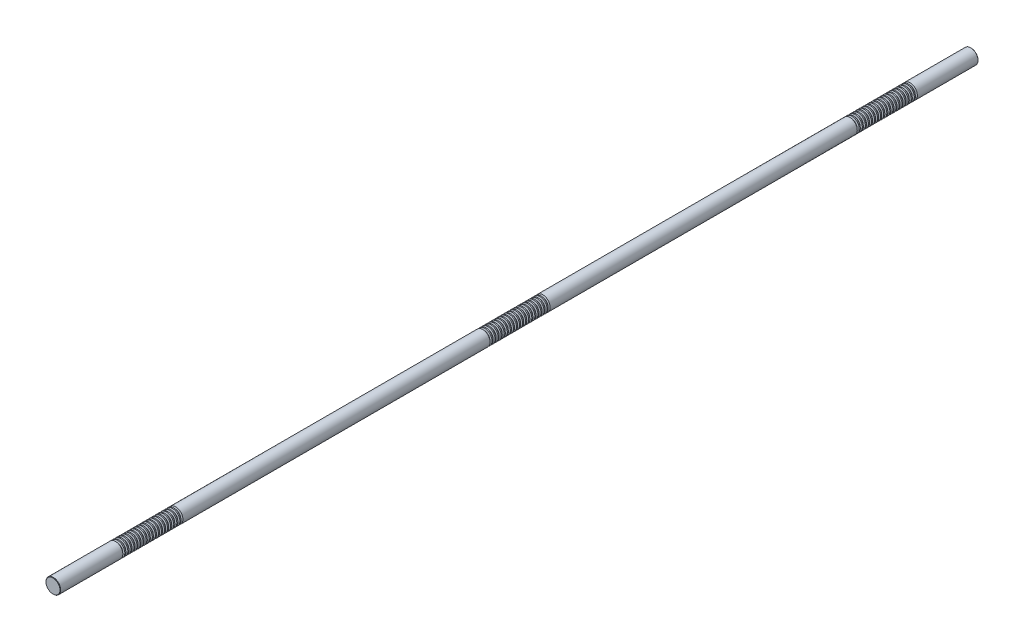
from build123d import *

# Parameters (mm, degrees)
SKETCH1_R           = 12
BOSS_EXTRUDE1_DEPTH = 750
CHAMFER1_SIZE       = 0.6
LPATTERN1_COUNT     = 20
LPATTERN1_PITCH     = 5
LPATTERN2_COUNT     = 3
LPATTERN2_PITCH     = 600


with BuildPart() as part:
    # Sketch1 → Boss-Extrude1 (new, symmetric)
    with BuildSketch(Plane.XY):
        Circle(SKETCH1_R)
    extrude(amount=BOSS_EXTRUDE1_DEPTH, both=True)

    # Chamfer1
    chamfer1_edges = [part.edges().sort_by_distance(p)[0] for p in [
        (-12, 0, -750),
        (-12, 0, 750),
    ]]
    chamfer(chamfer1_edges, length=CHAMFER1_SIZE)

    # Sketch2 → Cut-Revolve1 (revolve, cut)
    with BuildSketch(Plane(origin=(0, 0, 0), x_dir=(0, 0, -1), z_dir=(1, 0, 0)), mode=Mode.PRIVATE) as cut_revolve1_sk:
        Polygon((650.36843014, 12), (647.13156986, 12), (647.86843014, 9.25), (649.63156986, 9.25), align=None)
    cut_revolve1 = revolve(cut_revolve1_sk.sketch.rotate(Axis((0, 0, 750), (0, 0, -1)), 90), axis=Axis((0, 0, 750), (0, 0, -1)), mode=Mode.SUBTRACT)

    # LPattern1: Cut-Revolve1 ×20
    with Locations(*[(0, 0, i * LPATTERN1_PITCH) for i in range(1, LPATTERN1_COUNT)]):
        add(cut_revolve1, mode=Mode.SUBTRACT)

    # LPattern2: Cut-Revolve1 ×3
    with Locations(*[(0, 0, i * LPATTERN2_PITCH) for i in range(1, LPATTERN2_COUNT)]):
        add(cut_revolve1, mode=Mode.SUBTRACT)

    # LPattern2 copy 1 sketch → LPattern2 copy 1 (revolve, cut)
    with BuildSketch(Plane(origin=(0, 0, 605), x_dir=(0, 0, -1), z_dir=(1, 0, 0))):
        Polygon((650.36843014, 12), (647.13156986, 12), (647.86843014, 9.25), (649.63156986, 9.25), align=None)
    revolve(axis=Axis((0, 0, 1355), (0, 0, -1)), mode=Mode.SUBTRACT)

    # LPattern2 copy 2 sketch → LPattern2 copy 2 (revolve, cut)
    with BuildSketch(Plane(origin=(0, 0, 1205), x_dir=(0, 0, -1), z_dir=(1, 0, 0))):
        Polygon((650.36843014, 12), (647.13156986, 12), (647.86843014, 9.25), (649.63156986, 9.25), align=None)
    revolve(axis=Axis((0, 0, 1955), (0, 0, -1)), mode=Mode.SUBTRACT)

    # LPattern2 copy 3 sketch → LPattern2 copy 3 (revolve, cut)
    with BuildSketch(Plane(origin=(0, 0, 610), x_dir=(0, 0, -1), z_dir=(1, 0, 0))):
        Polygon((650.36843014, 12), (647.13156986, 12), (647.86843014, 9.25), (649.63156986, 9.25), align=None)
    revolve(axis=Axis((0, 0, 1360), (0, 0, -1)), mode=Mode.SUBTRACT)

    # LPattern2 copy 4 sketch → LPattern2 copy 4 (revolve, cut)
    with BuildSketch(Plane(origin=(0, 0, 1210), x_dir=(0, 0, -1), z_dir=(1, 0, 0))):
        Polygon((650.36843014, 12), (647.13156986, 12), (647.86843014, 9.25), (649.63156986, 9.25), align=None)
    revolve(axis=Axis((0, 0, 1960), (0, 0, -1)), mode=Mode.SUBTRACT)

    # LPattern2 copy 5 sketch → LPattern2 copy 5 (revolve, cut)
    with BuildSketch(Plane(origin=(0, 0, 615), x_dir=(0, 0, -1), z_dir=(1, 0, 0))):
        Polygon((650.36843014, 12), (647.13156986, 12), (647.86843014, 9.25), (649.63156986, 9.25), align=None)
    revolve(axis=Axis((0, 0, 1365), (0, 0, -1)), mode=Mode.SUBTRACT)

    # LPattern2 copy 6 sketch → LPattern2 copy 6 (revolve, cut)
    with BuildSketch(Plane(origin=(0, 0, 1215), x_dir=(0, 0, -1), z_dir=(1, 0, 0))):
        Polygon((650.36843014, 12), (647.13156986, 12), (647.86843014, 9.25), (649.63156986, 9.25), align=None)
    revolve(axis=Axis((0, 0, 1965), (0, 0, -1)), mode=Mode.SUBTRACT)

    # LPattern2 copy 7 sketch → LPattern2 copy 7 (revolve, cut)
    with BuildSketch(Plane(origin=(0, 0, 620), x_dir=(0, 0, -1), z_dir=(1, 0, 0))):
        Polygon((650.36843014, 12), (647.13156986, 12), (647.86843014, 9.25), (649.63156986, 9.25), align=None)
    revolve(axis=Axis((0, 0, 1370), (0, 0, -1)), mode=Mode.SUBTRACT)

    # LPattern2 copy 8 sketch → LPattern2 copy 8 (revolve, cut)
    with BuildSketch(Plane(origin=(0, 0, 1220), x_dir=(0, 0, -1), z_dir=(1, 0, 0))):
        Polygon((650.36843014, 12), (647.13156986, 12), (647.86843014, 9.25), (649.63156986, 9.25), align=None)
    revolve(axis=Axis((0, 0, 1970), (0, 0, -1)), mode=Mode.SUBTRACT)

    # LPattern2 copy 9 sketch → LPattern2 copy 9 (revolve, cut)
    with BuildSketch(Plane(origin=(0, 0, 625), x_dir=(0, 0, -1), z_dir=(1, 0, 0))):
        Polygon((650.36843014, 12), (647.13156986, 12), (647.86843014, 9.25), (649.63156986, 9.25), align=None)
    revolve(axis=Axis((0, 0, 1375), (0, 0, -1)), mode=Mode.SUBTRACT)

    # LPattern2 copy 10 sketch → LPattern2 copy 10 (revolve, cut)
    with BuildSketch(Plane(origin=(0, 0, 1225), x_dir=(0, 0, -1), z_dir=(1, 0, 0))):
        Polygon((650.36843014, 12), (647.13156986, 12), (647.86843014, 9.25), (649.63156986, 9.25), align=None)
    revolve(axis=Axis((0, 0, 1975), (0, 0, -1)), mode=Mode.SUBTRACT)

    # LPattern2 copy 11 sketch → LPattern2 copy 11 (revolve, cut)
    with BuildSketch(Plane(origin=(0, 0, 630), x_dir=(0, 0, -1), z_dir=(1, 0, 0))):
        Polygon((650.36843014, 12), (647.13156986, 12), (647.86843014, 9.25), (649.63156986, 9.25), align=None)
    revolve(axis=Axis((0, 0, 1380), (0, 0, -1)), mode=Mode.SUBTRACT)

    # LPattern2 copy 12 sketch → LPattern2 copy 12 (revolve, cut)
    with BuildSketch(Plane(origin=(0, 0, 1230), x_dir=(0, 0, -1), z_dir=(1, 0, 0))):
        Polygon((650.36843014, 12), (647.13156986, 12), (647.86843014, 9.25), (649.63156986, 9.25), align=None)
    revolve(axis=Axis((0, 0, 1980), (0, 0, -1)), mode=Mode.SUBTRACT)

    # LPattern2 copy 13 sketch → LPattern2 copy 13 (revolve, cut)
    with BuildSketch(Plane(origin=(0, 0, 635), x_dir=(0, 0, -1), z_dir=(1, 0, 0))):
        Polygon((650.36843014, 12), (647.13156986, 12), (647.86843014, 9.25), (649.63156986, 9.25), align=None)
    revolve(axis=Axis((0, 0, 1385), (0, 0, -1)), mode=Mode.SUBTRACT)

    # LPattern2 copy 14 sketch → LPattern2 copy 14 (revolve, cut)
    with BuildSketch(Plane(origin=(0, 0, 1235), x_dir=(0, 0, -1), z_dir=(1, 0, 0))):
        Polygon((650.36843014, 12), (647.13156986, 12), (647.86843014, 9.25), (649.63156986, 9.25), align=None)
    revolve(axis=Axis((0, 0, 1985), (0, 0, -1)), mode=Mode.SUBTRACT)

    # LPattern2 copy 15 sketch → LPattern2 copy 15 (revolve, cut)
    with BuildSketch(Plane(origin=(0, 0, 640), x_dir=(0, 0, -1), z_dir=(1, 0, 0))):
        Polygon((650.36843014, 12), (647.13156986, 12), (647.86843014, 9.25), (649.63156986, 9.25), align=None)
    revolve(axis=Axis((0, 0, 1390), (0, 0, -1)), mode=Mode.SUBTRACT)

    # LPattern2 copy 16 sketch → LPattern2 copy 16 (revolve, cut)
    with BuildSketch(Plane(origin=(0, 0, 1240), x_dir=(0, 0, -1), z_dir=(1, 0, 0))):
        Polygon((650.36843014, 12), (647.13156986, 12), (647.86843014, 9.25), (649.63156986, 9.25), align=None)
    revolve(axis=Axis((0, 0, 1990), (0, 0, -1)), mode=Mode.SUBTRACT)

    # LPattern2 copy 17 sketch → LPattern2 copy 17 (revolve, cut)
    with BuildSketch(Plane(origin=(0, 0, 645), x_dir=(0, 0, -1), z_dir=(1, 0, 0))):
        Polygon((650.36843014, 12), (647.13156986, 12), (647.86843014, 9.25), (649.63156986, 9.25), align=None)
    revolve(axis=Axis((0, 0, 1395), (0, 0, -1)), mode=Mode.SUBTRACT)

    # LPattern2 copy 18 sketch → LPattern2 copy 18 (revolve, cut)
    with BuildSketch(Plane(origin=(0, 0, 1245), x_dir=(0, 0, -1), z_dir=(1, 0, 0))):
        Polygon((650.36843014, 12), (647.13156986, 12), (647.86843014, 9.25), (649.63156986, 9.25), align=None)
    revolve(axis=Axis((0, 0, 1995), (0, 0, -1)), mode=Mode.SUBTRACT)

    # LPattern2 copy 19 sketch → LPattern2 copy 19 (revolve, cut)
    with BuildSketch(Plane(origin=(0, 0, 650), x_dir=(0, 0, -1), z_dir=(1, 0, 0))):
        Polygon((650.36843014, 12), (647.13156986, 12), (647.86843014, 9.25), (649.63156986, 9.25), align=None)
    revolve(axis=Axis((0, 0, 1400), (0, 0, -1)), mode=Mode.SUBTRACT)

    # LPattern2 copy 20 sketch → LPattern2 copy 20 (revolve, cut)
    with BuildSketch(Plane(origin=(0, 0, 1250), x_dir=(0, 0, -1), z_dir=(1, 0, 0))):
        Polygon((650.36843014, 12), (647.13156986, 12), (647.86843014, 9.25), (649.63156986, 9.25), align=None)
    revolve(axis=Axis((0, 0, 2000), (0, 0, -1)), mode=Mode.SUBTRACT)

    # LPattern2 copy 21 sketch → LPattern2 copy 21 (revolve, cut)
    with BuildSketch(Plane(origin=(0, 0, 655), x_dir=(0, 0, -1), z_dir=(1, 0, 0))):
        Polygon((650.36843014, 12), (647.13156986, 12), (647.86843014, 9.25), (649.63156986, 9.25), align=None)
    revolve(axis=Axis((0, 0, 1405), (0, 0, -1)), mode=Mode.SUBTRACT)

    # LPattern2 copy 22 sketch → LPattern2 copy 22 (revolve, cut)
    with BuildSketch(Plane(origin=(0, 0, 1255), x_dir=(0, 0, -1), z_dir=(1, 0, 0))):
        Polygon((650.36843014, 12), (647.13156986, 12), (647.86843014, 9.25), (649.63156986, 9.25), align=None)
    revolve(axis=Axis((0, 0, 2005), (0, 0, -1)), mode=Mode.SUBTRACT)

    # LPattern2 copy 23 sketch → LPattern2 copy 23 (revolve, cut)
    with BuildSketch(Plane(origin=(0, 0, 660), x_dir=(0, 0, -1), z_dir=(1, 0, 0))):
        Polygon((650.36843014, 12), (647.13156986, 12), (647.86843014, 9.25), (649.63156986, 9.25), align=None)
    revolve(axis=Axis((0, 0, 1410), (0, 0, -1)), mode=Mode.SUBTRACT)

    # LPattern2 copy 24 sketch → LPattern2 copy 24 (revolve, cut)
    with BuildSketch(Plane(origin=(0, 0, 1260), x_dir=(0, 0, -1), z_dir=(1, 0, 0))):
        Polygon((650.36843014, 12), (647.13156986, 12), (647.86843014, 9.25), (649.63156986, 9.25), align=None)
    revolve(axis=Axis((0, 0, 2010), (0, 0, -1)), mode=Mode.SUBTRACT)

    # LPattern2 copy 25 sketch → LPattern2 copy 25 (revolve, cut)
    with BuildSketch(Plane(origin=(0, 0, 665), x_dir=(0, 0, -1), z_dir=(1, 0, 0))):
        Polygon((650.36843014, 12), (647.13156986, 12), (647.86843014, 9.25), (649.63156986, 9.25), align=None)
    revolve(axis=Axis((0, 0, 1415), (0, 0, -1)), mode=Mode.SUBTRACT)

    # LPattern2 copy 26 sketch → LPattern2 copy 26 (revolve, cut)
    with BuildSketch(Plane(origin=(0, 0, 1265), x_dir=(0, 0, -1), z_dir=(1, 0, 0))):
        Polygon((650.36843014, 12), (647.13156986, 12), (647.86843014, 9.25), (649.63156986, 9.25), align=None)
    revolve(axis=Axis((0, 0, 2015), (0, 0, -1)), mode=Mode.SUBTRACT)

    # LPattern2 copy 27 sketch → LPattern2 copy 27 (revolve, cut)
    with BuildSketch(Plane(origin=(0, 0, 670), x_dir=(0, 0, -1), z_dir=(1, 0, 0))):
        Polygon((650.36843014, 12), (647.13156986, 12), (647.86843014, 9.25), (649.63156986, 9.25), align=None)
    revolve(axis=Axis((0, 0, 1420), (0, 0, -1)), mode=Mode.SUBTRACT)

    # LPattern2 copy 28 sketch → LPattern2 copy 28 (revolve, cut)
    with BuildSketch(Plane(origin=(0, 0, 1270), x_dir=(0, 0, -1), z_dir=(1, 0, 0))):
        Polygon((650.36843014, 12), (647.13156986, 12), (647.86843014, 9.25), (649.63156986, 9.25), align=None)
    revolve(axis=Axis((0, 0, 2020), (0, 0, -1)), mode=Mode.SUBTRACT)

    # LPattern2 copy 29 sketch → LPattern2 copy 29 (revolve, cut)
    with BuildSketch(Plane(origin=(0, 0, 675), x_dir=(0, 0, -1), z_dir=(1, 0, 0))):
        Polygon((650.36843014, 12), (647.13156986, 12), (647.86843014, 9.25), (649.63156986, 9.25), align=None)
    revolve(axis=Axis((0, 0, 1425), (0, 0, -1)), mode=Mode.SUBTRACT)

    # LPattern2 copy 30 sketch → LPattern2 copy 30 (revolve, cut)
    with BuildSketch(Plane(origin=(0, 0, 1275), x_dir=(0, 0, -1), z_dir=(1, 0, 0))):
        Polygon((650.36843014, 12), (647.13156986, 12), (647.86843014, 9.25), (649.63156986, 9.25), align=None)
    revolve(axis=Axis((0, 0, 2025), (0, 0, -1)), mode=Mode.SUBTRACT)

    # LPattern2 copy 31 sketch → LPattern2 copy 31 (revolve, cut)
    with BuildSketch(Plane(origin=(0, 0, 680), x_dir=(0, 0, -1), z_dir=(1, 0, 0))):
        Polygon((650.36843014, 12), (647.13156986, 12), (647.86843014, 9.25), (649.63156986, 9.25), align=None)
    revolve(axis=Axis((0, 0, 1430), (0, 0, -1)), mode=Mode.SUBTRACT)

    # LPattern2 copy 32 sketch → LPattern2 copy 32 (revolve, cut)
    with BuildSketch(Plane(origin=(0, 0, 1280), x_dir=(0, 0, -1), z_dir=(1, 0, 0))):
        Polygon((650.36843014, 12), (647.13156986, 12), (647.86843014, 9.25), (649.63156986, 9.25), align=None)
    revolve(axis=Axis((0, 0, 2030), (0, 0, -1)), mode=Mode.SUBTRACT)

    # LPattern2 copy 33 sketch → LPattern2 copy 33 (revolve, cut)
    with BuildSketch(Plane(origin=(0, 0, 685), x_dir=(0, 0, -1), z_dir=(1, 0, 0))):
        Polygon((650.36843014, 12), (647.13156986, 12), (647.86843014, 9.25), (649.63156986, 9.25), align=None)
    revolve(axis=Axis((0, 0, 1435), (0, 0, -1)), mode=Mode.SUBTRACT)

    # LPattern2 copy 34 sketch → LPattern2 copy 34 (revolve, cut)
    with BuildSketch(Plane(origin=(0, 0, 1285), x_dir=(0, 0, -1), z_dir=(1, 0, 0))):
        Polygon((650.36843014, 12), (647.13156986, 12), (647.86843014, 9.25), (649.63156986, 9.25), align=None)
    revolve(axis=Axis((0, 0, 2035), (0, 0, -1)), mode=Mode.SUBTRACT)

    # LPattern2 copy 35 sketch → LPattern2 copy 35 (revolve, cut)
    with BuildSketch(Plane(origin=(0, 0, 690), x_dir=(0, 0, -1), z_dir=(1, 0, 0))):
        Polygon((650.36843014, 12), (647.13156986, 12), (647.86843014, 9.25), (649.63156986, 9.25), align=None)
    revolve(axis=Axis((0, 0, 1440), (0, 0, -1)), mode=Mode.SUBTRACT)

    # LPattern2 copy 36 sketch → LPattern2 copy 36 (revolve, cut)
    with BuildSketch(Plane(origin=(0, 0, 1290), x_dir=(0, 0, -1), z_dir=(1, 0, 0))):
        Polygon((650.36843014, 12), (647.13156986, 12), (647.86843014, 9.25), (649.63156986, 9.25), align=None)
    revolve(axis=Axis((0, 0, 2040), (0, 0, -1)), mode=Mode.SUBTRACT)

    # LPattern2 copy 37 sketch → LPattern2 copy 37 (revolve, cut)
    with BuildSketch(Plane(origin=(0, 0, 695), x_dir=(0, 0, -1), z_dir=(1, 0, 0))):
        Polygon((650.36843014, 12), (647.13156986, 12), (647.86843014, 9.25), (649.63156986, 9.25), align=None)
    revolve(axis=Axis((0, 0, 1445), (0, 0, -1)), mode=Mode.SUBTRACT)

    # LPattern2 copy 38 sketch → LPattern2 copy 38 (revolve, cut)
    with BuildSketch(Plane(origin=(0, 0, 1295), x_dir=(0, 0, -1), z_dir=(1, 0, 0))):
        Polygon((650.36843014, 12), (647.13156986, 12), (647.86843014, 9.25), (649.63156986, 9.25), align=None)
    revolve(axis=Axis((0, 0, 2045), (0, 0, -1)), mode=Mode.SUBTRACT)


solid = part.part
